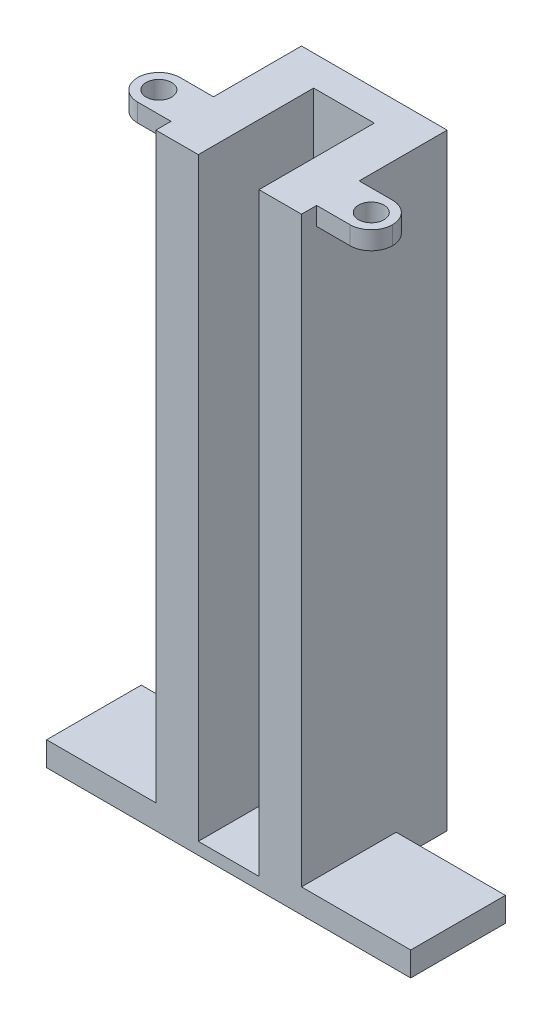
ISO-10303-21;
HEADER;
FILE_DESCRIPTION(('STEP AP214'),'2;1');
FILE_NAME('part.step','',(''),(''),'','','');
FILE_SCHEMA(('AUTOMOTIVE_DESIGN { 1 0 10303 214 1 1 1 1 }'));
ENDSEC;
DATA;
#1=APPLICATION_CONTEXT('core data for automotive mechanical design processes');
#2=APPLICATION_PROTOCOL_DEFINITION('international standard','automotive_design',2000,#1);
#3=PRODUCT_CONTEXT('',#1,'mechanical');
#4=PRODUCT('Part','Part','',(#3));
#5=PRODUCT_RELATED_PRODUCT_CATEGORY('part','',(#4));
#6=PRODUCT_DEFINITION_FORMATION('','',#4);
#7=PRODUCT_DEFINITION_CONTEXT('part definition',#1,'design');
#8=PRODUCT_DEFINITION('design','',#6,#7);
#9=PRODUCT_DEFINITION_SHAPE('','',#8);
#10=(LENGTH_UNIT() NAMED_UNIT(*) SI_UNIT(.MILLI.,.METRE.));
#11=(NAMED_UNIT(*) PLANE_ANGLE_UNIT() SI_UNIT($,.RADIAN.));
#12=(NAMED_UNIT(*) SI_UNIT($,.STERADIAN.) SOLID_ANGLE_UNIT());
#13=UNCERTAINTY_MEASURE_WITH_UNIT(LENGTH_MEASURE(1.E-05),#10,'distance_accuracy_value','');
#14=(GEOMETRIC_REPRESENTATION_CONTEXT(3) GLOBAL_UNCERTAINTY_ASSIGNED_CONTEXT((#13)) GLOBAL_UNIT_ASSIGNED_CONTEXT((#10,
#11,#12)) REPRESENTATION_CONTEXT('',''));
#15=CARTESIAN_POINT('',(0.,0.,0.));
#16=DIRECTION('',(0.,0.,1.));
#17=DIRECTION('',(1.,0.,0.));
#18=AXIS2_PLACEMENT_3D('',#15,#16,#17);
#19=CARTESIAN_POINT('',(12.,100.,-12.));
#20=DIRECTION('',(-1.,0.,0.));
#21=DIRECTION('',(0.,0.,1.));
#22=AXIS2_PLACEMENT_3D('',#19,#20,#21);
#23=PLANE('',#22);
#24=DIRECTION('',(0.,1.,0.));
#25=VECTOR('',#24,1.);
#26=CARTESIAN_POINT('',(12.,97.,2.50000000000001));
#27=LINE('',#26,#25);
#28=CARTESIAN_POINT('',(12.,97.,2.50000000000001));
#29=VERTEX_POINT('',#28);
#30=CARTESIAN_POINT('',(12.,100.,2.50000000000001));
#31=VERTEX_POINT('',#30);
#32=EDGE_CURVE('E197',#29,#31,#27,.T.);
#33=ORIENTED_EDGE('',*,*,#32,.F.);
#34=DIRECTION('',(0.,0.,-1.));
#35=VECTOR('',#34,1.);
#36=CARTESIAN_POINT('',(12.,97.,2.50000000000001));
#37=LINE('',#36,#35);
#38=CARTESIAN_POINT('',(12.,97.,9.50000000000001));
#39=VERTEX_POINT('',#38);
#40=EDGE_CURVE('E204',#39,#29,#37,.T.);
#41=ORIENTED_EDGE('',*,*,#40,.F.);
#42=DIRECTION('',(0.,1.,0.));
#43=VECTOR('',#42,1.);
#44=CARTESIAN_POINT('',(12.,97.,9.50000000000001));
#45=LINE('',#44,#43);
#46=CARTESIAN_POINT('',(12.,100.,9.50000000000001));
#47=VERTEX_POINT('',#46);
#48=EDGE_CURVE('E214',#39,#47,#45,.T.);
#49=ORIENTED_EDGE('',*,*,#48,.T.);
#50=DIRECTION('',(0.,0.,-1.));
#51=VECTOR('',#50,1.);
#52=CARTESIAN_POINT('',(12.,100.,-12.));
#53=LINE('',#52,#51);
#54=CARTESIAN_POINT('',(12.,100.,12.));
#55=VERTEX_POINT('',#54);
#56=EDGE_CURVE('E338',#55,#47,#53,.T.);
#57=ORIENTED_EDGE('',*,*,#56,.F.);
#58=DIRECTION('',(0.,-1.,0.));
#59=VECTOR('',#58,1.);
#60=CARTESIAN_POINT('',(12.,100.,12.));
#61=LINE('',#60,#59);
#62=CARTESIAN_POINT('',(12.,4.,12.));
#63=VERTEX_POINT('',#62);
#64=EDGE_CURVE('E354',#55,#63,#61,.T.);
#65=ORIENTED_EDGE('',*,*,#64,.T.);
#66=DIRECTION('',(0.,0.,-1.));
#67=VECTOR('',#66,1.);
#68=CARTESIAN_POINT('',(12.,4.,12.));
#69=LINE('',#68,#67);
#70=CARTESIAN_POINT('',(12.,4.,-3.59999999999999));
#71=VERTEX_POINT('',#70);
#72=EDGE_CURVE('E268',#63,#71,#69,.T.);
#73=ORIENTED_EDGE('',*,*,#72,.T.);
#74=DIRECTION('',(0.,1.,0.));
#75=VECTOR('',#74,1.);
#76=CARTESIAN_POINT('',(12.,-19.8635344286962,-3.6));
#77=LINE('',#76,#75);
#78=CARTESIAN_POINT('',(12.,0.,-3.59999999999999));
#79=VERTEX_POINT('',#78);
#80=EDGE_CURVE('E275',#79,#71,#77,.T.);
#81=ORIENTED_EDGE('',*,*,#80,.F.);
#82=DIRECTION('',(0.,0.,1.));
#83=VECTOR('',#82,1.);
#84=CARTESIAN_POINT('',(12.,0.,-12.));
#85=LINE('',#84,#83);
#86=CARTESIAN_POINT('',(12.,0.,-12.));
#87=VERTEX_POINT('',#86);
#88=EDGE_CURVE('E265',#87,#79,#85,.T.);
#89=ORIENTED_EDGE('',*,*,#88,.F.);
#90=DIRECTION('',(0.,-1.,0.));
#91=VECTOR('',#90,1.);
#92=CARTESIAN_POINT('',(12.,100.,-12.));
#93=LINE('',#92,#91);
#94=CARTESIAN_POINT('',(12.,100.,-12.));
#95=VERTEX_POINT('',#94);
#96=EDGE_CURVE('E366',#95,#87,#93,.T.);
#97=ORIENTED_EDGE('',*,*,#96,.F.);
#98=EDGE_CURVE('E207',#31,#95,#53,.T.);
#99=ORIENTED_EDGE('',*,*,#98,.F.);
#100=EDGE_LOOP('',(#33,#41,#49,#57,#65,#73,#81,#89,#97,#99));
#101=FACE_BOUND('',#100,.T.);
#102=ADVANCED_FACE('F41',(#101),#23,.F.);
#103=CARTESIAN_POINT('',(-12.,100.,-12.));
#104=DIRECTION('',(1.,0.,0.));
#105=DIRECTION('',(0.,0.,-1.));
#106=AXIS2_PLACEMENT_3D('',#103,#104,#105);
#107=PLANE('',#106);
#108=DIRECTION('',(0.,1.,0.));
#109=VECTOR('',#108,1.);
#110=CARTESIAN_POINT('',(-12.,97.,9.50000000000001));
#111=LINE('',#110,#109);
#112=CARTESIAN_POINT('',(-12.,97.,9.50000000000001));
#113=VERTEX_POINT('',#112);
#114=CARTESIAN_POINT('',(-12.,100.,9.50000000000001));
#115=VERTEX_POINT('',#114);
#116=EDGE_CURVE('E252',#113,#115,#111,.T.);
#117=ORIENTED_EDGE('',*,*,#116,.F.);
#118=DIRECTION('',(0.,0.,-1.));
#119=VECTOR('',#118,1.);
#120=CARTESIAN_POINT('',(-12.,97.,2.50000000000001));
#121=LINE('',#120,#119);
#122=CARTESIAN_POINT('',(-12.,97.,2.50000000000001));
#123=VERTEX_POINT('',#122);
#124=EDGE_CURVE('E238',#113,#123,#121,.T.);
#125=ORIENTED_EDGE('',*,*,#124,.T.);
#126=DIRECTION('',(0.,1.,0.));
#127=VECTOR('',#126,1.);
#128=CARTESIAN_POINT('',(-12.,97.,2.50000000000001));
#129=LINE('',#128,#127);
#130=CARTESIAN_POINT('',(-12.,100.,2.50000000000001));
#131=VERTEX_POINT('',#130);
#132=EDGE_CURVE('E246',#123,#131,#129,.T.);
#133=ORIENTED_EDGE('',*,*,#132,.T.);
#134=DIRECTION('',(0.,0.,1.));
#135=VECTOR('',#134,1.);
#136=CARTESIAN_POINT('',(-12.,100.,-12.));
#137=LINE('',#136,#135);
#138=CARTESIAN_POINT('',(-12.,100.,-12.));
#139=VERTEX_POINT('',#138);
#140=EDGE_CURVE('E346',#139,#131,#137,.T.);
#141=ORIENTED_EDGE('',*,*,#140,.F.);
#142=DIRECTION('',(0.,-1.,0.));
#143=VECTOR('',#142,1.);
#144=CARTESIAN_POINT('',(-12.,100.,-12.));
#145=LINE('',#144,#143);
#146=CARTESIAN_POINT('',(-12.,0.,-12.));
#147=VERTEX_POINT('',#146);
#148=EDGE_CURVE('E361',#139,#147,#145,.T.);
#149=ORIENTED_EDGE('',*,*,#148,.T.);
#150=DIRECTION('',(0.,0.,1.));
#151=VECTOR('',#150,1.);
#152=CARTESIAN_POINT('',(-12.,0.,-12.));
#153=LINE('',#152,#151);
#154=CARTESIAN_POINT('',(-12.,0.,-3.59999999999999));
#155=VERTEX_POINT('',#154);
#156=EDGE_CURVE('E288',#147,#155,#153,.T.);
#157=ORIENTED_EDGE('',*,*,#156,.T.);
#158=DIRECTION('',(0.,1.,0.));
#159=VECTOR('',#158,1.);
#160=CARTESIAN_POINT('',(-12.,-19.8635344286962,-3.6));
#161=LINE('',#160,#159);
#162=CARTESIAN_POINT('',(-12.,4.,-3.59999999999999));
#163=VERTEX_POINT('',#162);
#164=EDGE_CURVE('E292',#155,#163,#161,.T.);
#165=ORIENTED_EDGE('',*,*,#164,.T.);
#166=DIRECTION('',(0.,0.,-1.));
#167=VECTOR('',#166,1.);
#168=CARTESIAN_POINT('',(-12.,4.,12.));
#169=LINE('',#168,#167);
#170=CARTESIAN_POINT('',(-12.,4.,12.));
#171=VERTEX_POINT('',#170);
#172=EDGE_CURVE('E299',#171,#163,#169,.T.);
#173=ORIENTED_EDGE('',*,*,#172,.F.);
#174=DIRECTION('',(0.,-1.,0.));
#175=VECTOR('',#174,1.);
#176=CARTESIAN_POINT('',(-12.,100.,12.));
#177=LINE('',#176,#175);
#178=CARTESIAN_POINT('',(-12.,100.,12.));
#179=VERTEX_POINT('',#178);
#180=EDGE_CURVE('E359',#179,#171,#177,.T.);
#181=ORIENTED_EDGE('',*,*,#180,.F.);
#182=EDGE_CURVE('E342',#115,#179,#137,.T.);
#183=ORIENTED_EDGE('',*,*,#182,.F.);
#184=EDGE_LOOP('',(#117,#125,#133,#141,#149,#157,#165,#173,#181,#183));
#185=FACE_BOUND('',#184,.T.);
#186=ADVANCED_FACE('F417',(#185),#107,.F.);
#187=CARTESIAN_POINT('',(-12.,100.,-12.));
#188=DIRECTION('',(0.,0.,1.));
#189=DIRECTION('',(1.,0.,0.));
#190=AXIS2_PLACEMENT_3D('',#187,#188,#189);
#191=PLANE('',#190);
#192=ORIENTED_EDGE('',*,*,#96,.T.);
#193=DIRECTION('',(-1.,0.,0.));
#194=VECTOR('',#193,1.);
#195=CARTESIAN_POINT('',(-12.,0.,-12.));
#196=LINE('',#195,#194);
#197=EDGE_CURVE('E339',#87,#147,#196,.T.);
#198=ORIENTED_EDGE('',*,*,#197,.T.);
#199=ORIENTED_EDGE('',*,*,#148,.F.);
#200=DIRECTION('',(-1.,0.,0.));
#201=VECTOR('',#200,1.);
#202=CARTESIAN_POINT('',(-12.,100.,-12.));
#203=LINE('',#202,#201);
#204=EDGE_CURVE('E345',#95,#139,#203,.T.);
#205=ORIENTED_EDGE('',*,*,#204,.F.);
#206=EDGE_LOOP('',(#192,#198,#199,#205));
#207=FACE_BOUND('',#206,.T.);
#208=ADVANCED_FACE('F425',(#207),#191,.F.);
#209=CARTESIAN_POINT('',(30.,4.,12.));
#210=DIRECTION('',(0.,1.,0.));
#211=DIRECTION('',(0.,0.,1.));
#212=AXIS2_PLACEMENT_3D('',#209,#210,#211);
#213=PLANE('',#212);
#214=DIRECTION('',(0.,0.,-1.));
#215=VECTOR('',#214,1.);
#216=CARTESIAN_POINT('',(30.,4.,12.));
#217=LINE('',#216,#215);
#218=CARTESIAN_POINT('',(30.,4.,12.));
#219=VERTEX_POINT('',#218);
#220=CARTESIAN_POINT('',(30.,4.,-3.59999999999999));
#221=VERTEX_POINT('',#220);
#222=EDGE_CURVE('E281',#219,#221,#217,.T.);
#223=ORIENTED_EDGE('',*,*,#222,.T.);
#224=DIRECTION('',(-1.,0.,0.));
#225=VECTOR('',#224,1.);
#226=CARTESIAN_POINT('',(30.,4.,-3.59999999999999));
#227=LINE('',#226,#225);
#228=EDGE_CURVE('E258',#221,#71,#227,.T.);
#229=ORIENTED_EDGE('',*,*,#228,.T.);
#230=ORIENTED_EDGE('',*,*,#72,.F.);
#231=DIRECTION('',(-1.,0.,0.));
#232=VECTOR('',#231,1.);
#233=CARTESIAN_POINT('',(30.,4.,12.));
#234=LINE('',#233,#232);
#235=EDGE_CURVE('E282',#219,#63,#234,.T.);
#236=ORIENTED_EDGE('',*,*,#235,.F.);
#237=EDGE_LOOP('',(#223,#229,#230,#236));
#238=FACE_BOUND('',#237,.T.);
#239=ADVANCED_FACE('F513',(#238),#213,.T.);
#240=CARTESIAN_POINT('',(30.,0.,0.));
#241=DIRECTION('',(1.,0.,0.));
#242=DIRECTION('',(0.,0.,1.));
#243=AXIS2_PLACEMENT_3D('',#240,#241,#242);
#244=PLANE('',#243);
#245=DIRECTION('',(0.,0.,1.));
#246=VECTOR('',#245,1.);
#247=CARTESIAN_POINT('',(30.,0.,12.));
#248=LINE('',#247,#246);
#249=CARTESIAN_POINT('',(30.,0.,-3.59999999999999));
#250=VERTEX_POINT('',#249);
#251=CARTESIAN_POINT('',(30.,0.,12.));
#252=VERTEX_POINT('',#251);
#253=EDGE_CURVE('E278',#250,#252,#248,.T.);
#254=ORIENTED_EDGE('',*,*,#253,.F.);
#255=DIRECTION('',(0.,1.,0.));
#256=VECTOR('',#255,1.);
#257=CARTESIAN_POINT('',(30.,-19.8635344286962,-3.6));
#258=LINE('',#257,#256);
#259=EDGE_CURVE('E266',#250,#221,#258,.T.);
#260=ORIENTED_EDGE('',*,*,#259,.T.);
#261=ORIENTED_EDGE('',*,*,#222,.F.);
#262=DIRECTION('',(0.,1.,0.));
#263=VECTOR('',#262,1.);
#264=CARTESIAN_POINT('',(30.,0.,12.));
#265=LINE('',#264,#263);
#266=EDGE_CURVE('E279',#252,#219,#265,.T.);
#267=ORIENTED_EDGE('',*,*,#266,.F.);
#268=EDGE_LOOP('',(#254,#260,#261,#267));
#269=FACE_BOUND('',#268,.T.);
#270=ADVANCED_FACE('F515',(#269),#244,.T.);
#271=CARTESIAN_POINT('',(0.,0.,0.));
#272=DIRECTION('',(0.,1.,0.));
#273=DIRECTION('',(0.,0.,1.));
#274=AXIS2_PLACEMENT_3D('',#271,#272,#273);
#275=PLANE('',#274);
#276=ORIENTED_EDGE('',*,*,#88,.T.);
#277=DIRECTION('',(1.,0.,0.));
#278=VECTOR('',#277,1.);
#279=CARTESIAN_POINT('',(30.,0.,-3.59999999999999));
#280=LINE('',#279,#278);
#281=EDGE_CURVE('E264',#79,#250,#280,.T.);
#282=ORIENTED_EDGE('',*,*,#281,.T.);
#283=ORIENTED_EDGE('',*,*,#253,.T.);
#284=DIRECTION('',(1.,0.,0.));
#285=VECTOR('',#284,1.);
#286=CARTESIAN_POINT('',(-12.,0.,12.));
#287=LINE('',#286,#285);
#288=CARTESIAN_POINT('',(-30.,0.,12.));
#289=VERTEX_POINT('',#288);
#290=EDGE_CURVE('E355',#289,#252,#287,.T.);
#291=ORIENTED_EDGE('',*,*,#290,.F.);
#292=DIRECTION('',(0.,0.,1.));
#293=VECTOR('',#292,1.);
#294=CARTESIAN_POINT('',(-30.,0.,12.));
#295=LINE('',#294,#293);
#296=CARTESIAN_POINT('',(-30.,0.,-3.59999999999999));
#297=VERTEX_POINT('',#296);
#298=EDGE_CURVE('E306',#297,#289,#295,.T.);
#299=ORIENTED_EDGE('',*,*,#298,.F.);
#300=DIRECTION('',(-1.,0.,0.));
#301=VECTOR('',#300,1.);
#302=CARTESIAN_POINT('',(-30.,0.,-3.59999999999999));
#303=LINE('',#302,#301);
#304=EDGE_CURVE('E293',#155,#297,#303,.T.);
#305=ORIENTED_EDGE('',*,*,#304,.F.);
#306=ORIENTED_EDGE('',*,*,#156,.F.);
#307=ORIENTED_EDGE('',*,*,#197,.F.);
#308=EDGE_LOOP('',(#276,#282,#283,#291,#299,#305,#306,#307));
#309=FACE_BOUND('',#308,.T.);
#310=ADVANCED_FACE('F466',(#309),#275,.F.);
#311=CARTESIAN_POINT('',(-30.,4.,12.));
#312=DIRECTION('',(0.,-1.,0.));
#313=DIRECTION('',(0.,0.,-1.));
#314=AXIS2_PLACEMENT_3D('',#311,#312,#313);
#315=PLANE('',#314);
#316=DIRECTION('',(1.,0.,0.));
#317=VECTOR('',#316,1.);
#318=CARTESIAN_POINT('',(-30.,4.,-3.59999999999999));
#319=LINE('',#318,#317);
#320=CARTESIAN_POINT('',(-30.,4.,-3.59999999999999));
#321=VERTEX_POINT('',#320);
#322=EDGE_CURVE('E289',#321,#163,#319,.T.);
#323=ORIENTED_EDGE('',*,*,#322,.F.);
#324=DIRECTION('',(0.,0.,-1.));
#325=VECTOR('',#324,1.);
#326=CARTESIAN_POINT('',(-30.,4.,12.));
#327=LINE('',#326,#325);
#328=CARTESIAN_POINT('',(-30.,4.,12.));
#329=VERTEX_POINT('',#328);
#330=EDGE_CURVE('E303',#329,#321,#327,.T.);
#331=ORIENTED_EDGE('',*,*,#330,.F.);
#332=DIRECTION('',(1.,0.,0.));
#333=VECTOR('',#332,1.);
#334=CARTESIAN_POINT('',(-30.,4.,12.));
#335=LINE('',#334,#333);
#336=EDGE_CURVE('E308',#329,#171,#335,.T.);
#337=ORIENTED_EDGE('',*,*,#336,.T.);
#338=ORIENTED_EDGE('',*,*,#172,.T.);
#339=EDGE_LOOP('',(#323,#331,#337,#338));
#340=FACE_BOUND('',#339,.T.);
#341=ADVANCED_FACE('F479',(#340),#315,.F.);
#342=CARTESIAN_POINT('',(-12.,100.,12.));
#343=DIRECTION('',(0.,0.,-1.));
#344=DIRECTION('',(-1.,0.,0.));
#345=AXIS2_PLACEMENT_3D('',#342,#343,#344);
#346=PLANE('',#345);
#347=DIRECTION('',(0.,1.,0.));
#348=VECTOR('',#347,1.);
#349=CARTESIAN_POINT('',(5.,-21.4709105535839,12.));
#350=LINE('',#349,#348);
#351=CARTESIAN_POINT('',(5.,2.,12.));
#352=VERTEX_POINT('',#351);
#353=CARTESIAN_POINT('',(5.,100.,12.));
#354=VERTEX_POINT('',#353);
#355=EDGE_CURVE('E334',#352,#354,#350,.T.);
#356=ORIENTED_EDGE('',*,*,#355,.F.);
#357=DIRECTION('',(-1.,0.,0.));
#358=VECTOR('',#357,1.);
#359=CARTESIAN_POINT('',(-5.,2.,12.));
#360=LINE('',#359,#358);
#361=CARTESIAN_POINT('',(-5.,2.,12.));
#362=VERTEX_POINT('',#361);
#363=EDGE_CURVE('E324',#352,#362,#360,.T.);
#364=ORIENTED_EDGE('',*,*,#363,.T.);
#365=DIRECTION('',(0.,1.,0.));
#366=VECTOR('',#365,1.);
#367=CARTESIAN_POINT('',(-5.,-21.4709105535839,12.));
#368=LINE('',#367,#366);
#369=CARTESIAN_POINT('',(-5.,100.,12.));
#370=VERTEX_POINT('',#369);
#371=EDGE_CURVE('E328',#362,#370,#368,.T.);
#372=ORIENTED_EDGE('',*,*,#371,.T.);
#373=DIRECTION('',(1.,0.,0.));
#374=VECTOR('',#373,1.);
#375=CARTESIAN_POINT('',(-12.,100.,12.));
#376=LINE('',#375,#374);
#377=EDGE_CURVE('E349',#179,#370,#376,.T.);
#378=ORIENTED_EDGE('',*,*,#377,.F.);
#379=ORIENTED_EDGE('',*,*,#180,.T.);
#380=ORIENTED_EDGE('',*,*,#336,.F.);
#381=DIRECTION('',(0.,1.,0.));
#382=VECTOR('',#381,1.);
#383=CARTESIAN_POINT('',(-30.,0.,12.));
#384=LINE('',#383,#382);
#385=EDGE_CURVE('E297',#289,#329,#384,.T.);
#386=ORIENTED_EDGE('',*,*,#385,.F.);
#387=ORIENTED_EDGE('',*,*,#290,.T.);
#388=ORIENTED_EDGE('',*,*,#266,.T.);
#389=ORIENTED_EDGE('',*,*,#235,.T.);
#390=ORIENTED_EDGE('',*,*,#64,.F.);
#391=EDGE_CURVE('E347',#354,#55,#376,.T.);
#392=ORIENTED_EDGE('',*,*,#391,.F.);
#393=EDGE_LOOP('',(#356,#364,#372,#378,#379,#380,#386,#387,#388,#389,#390,#392));
#394=FACE_BOUND('',#393,.T.);
#395=ADVANCED_FACE('F488',(#394),#346,.F.);
#396=CARTESIAN_POINT('',(0.,100.,0.));
#397=DIRECTION('',(0.,1.,0.));
#398=DIRECTION('',(0.,0.,1.));
#399=AXIS2_PLACEMENT_3D('',#396,#397,#398);
#400=PLANE('',#399);
#401=CARTESIAN_POINT('',(17.5,100.,6.00000000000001));
#402=DIRECTION('',(0.,-1.,0.));
#403=DIRECTION('',(0.,0.,1.));
#404=AXIS2_PLACEMENT_3D('',#401,#402,#403);
#405=CIRCLE('',#404,2.1);
#406=CARTESIAN_POINT('',(17.5,100.,8.10000000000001));
#407=VERTEX_POINT('',#406);
#408=EDGE_CURVE('E400',#407,#407,#405,.T.);
#409=ORIENTED_EDGE('',*,*,#408,.T.);
#410=EDGE_LOOP('',(#409));
#411=FACE_BOUND('',#410,.T.);
#412=CARTESIAN_POINT('',(-17.5,100.,6.00000000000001));
#413=DIRECTION('',(0.,1.,0.));
#414=DIRECTION('',(0.,0.,1.));
#415=AXIS2_PLACEMENT_3D('',#412,#413,#414);
#416=CIRCLE('',#415,2.1);
#417=CARTESIAN_POINT('',(-17.5,100.,8.10000000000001));
#418=VERTEX_POINT('',#417);
#419=EDGE_CURVE('E208',#418,#418,#416,.T.);
#420=ORIENTED_EDGE('',*,*,#419,.F.);
#421=EDGE_LOOP('',(#420));
#422=FACE_BOUND('',#421,.T.);
#423=CARTESIAN_POINT('',(17.5,100.,6.00000000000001));
#424=DIRECTION('',(0.,1.,0.));
#425=DIRECTION('',(0.,0.,1.));
#426=AXIS2_PLACEMENT_3D('',#423,#424,#425);
#427=CIRCLE('',#426,3.5);
#428=CARTESIAN_POINT('',(17.5,100.,9.50000000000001));
#429=VERTEX_POINT('',#428);
#430=CARTESIAN_POINT('',(21.,100.,6.00000000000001));
#431=VERTEX_POINT('',#430);
#432=EDGE_CURVE('E382',#429,#431,#427,.T.);
#433=ORIENTED_EDGE('',*,*,#432,.T.);
#434=CARTESIAN_POINT('',(17.5,100.,6.00000000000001));
#435=DIRECTION('',(0.,1.,0.));
#436=DIRECTION('',(0.,0.,1.));
#437=AXIS2_PLACEMENT_3D('',#434,#435,#436);
#438=CIRCLE('',#437,3.5);
#439=CARTESIAN_POINT('',(17.5,100.,2.50000000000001));
#440=VERTEX_POINT('',#439);
#441=EDGE_CURVE('E383',#431,#440,#438,.T.);
#442=ORIENTED_EDGE('',*,*,#441,.T.);
#443=DIRECTION('',(1.,0.,0.));
#444=VECTOR('',#443,1.);
#445=CARTESIAN_POINT('',(21.,100.,2.50000000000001));
#446=LINE('',#445,#444);
#447=EDGE_CURVE('E221',#31,#440,#446,.T.);
#448=ORIENTED_EDGE('',*,*,#447,.F.);
#449=ORIENTED_EDGE('',*,*,#98,.T.);
#450=ORIENTED_EDGE('',*,*,#204,.T.);
#451=ORIENTED_EDGE('',*,*,#140,.T.);
#452=DIRECTION('',(-1.,0.,0.));
#453=VECTOR('',#452,1.);
#454=CARTESIAN_POINT('',(-21.,100.,2.50000000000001));
#455=LINE('',#454,#453);
#456=CARTESIAN_POINT('',(-17.5,100.,2.50000000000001));
#457=VERTEX_POINT('',#456);
#458=EDGE_CURVE('E250',#131,#457,#455,.T.);
#459=ORIENTED_EDGE('',*,*,#458,.T.);
#460=CARTESIAN_POINT('',(-17.5,100.,6.00000000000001));
#461=DIRECTION('',(0.,1.,0.));
#462=DIRECTION('',(0.,0.,1.));
#463=AXIS2_PLACEMENT_3D('',#460,#461,#462);
#464=CIRCLE('',#463,3.5);
#465=CARTESIAN_POINT('',(-21.,100.,6.00000000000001));
#466=VERTEX_POINT('',#465);
#467=EDGE_CURVE('E373',#457,#466,#464,.T.);
#468=ORIENTED_EDGE('',*,*,#467,.T.);
#469=CARTESIAN_POINT('',(-17.5,100.,6.00000000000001));
#470=DIRECTION('',(0.,1.,0.));
#471=DIRECTION('',(0.,0.,1.));
#472=AXIS2_PLACEMENT_3D('',#469,#470,#471);
#473=CIRCLE('',#472,3.5);
#474=CARTESIAN_POINT('',(-17.5,100.,9.50000000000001));
#475=VERTEX_POINT('',#474);
#476=EDGE_CURVE('E371',#466,#475,#473,.T.);
#477=ORIENTED_EDGE('',*,*,#476,.T.);
#478=DIRECTION('',(1.,0.,0.));
#479=VECTOR('',#478,1.);
#480=CARTESIAN_POINT('',(-21.,100.,9.50000000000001));
#481=LINE('',#480,#479);
#482=EDGE_CURVE('E241',#475,#115,#481,.T.);
#483=ORIENTED_EDGE('',*,*,#482,.T.);
#484=ORIENTED_EDGE('',*,*,#182,.T.);
#485=ORIENTED_EDGE('',*,*,#377,.T.);
#486=DIRECTION('',(0.,0.,1.));
#487=VECTOR('',#486,1.);
#488=CARTESIAN_POINT('',(-5.,100.,12.));
#489=LINE('',#488,#487);
#490=CARTESIAN_POINT('',(-5.,100.,-7.));
#491=VERTEX_POINT('',#490);
#492=EDGE_CURVE('E312',#491,#370,#489,.T.);
#493=ORIENTED_EDGE('',*,*,#492,.F.);
#494=DIRECTION('',(-1.,0.,0.));
#495=VECTOR('',#494,1.);
#496=CARTESIAN_POINT('',(-5.,100.,-7.));
#497=LINE('',#496,#495);
#498=CARTESIAN_POINT('',(5.,100.,-7.));
#499=VERTEX_POINT('',#498);
#500=EDGE_CURVE('E322',#499,#491,#497,.T.);
#501=ORIENTED_EDGE('',*,*,#500,.F.);
#502=DIRECTION('',(0.,0.,-1.));
#503=VECTOR('',#502,1.);
#504=CARTESIAN_POINT('',(5.,100.,12.));
#505=LINE('',#504,#503);
#506=EDGE_CURVE('E325',#354,#499,#505,.T.);
#507=ORIENTED_EDGE('',*,*,#506,.F.);
#508=ORIENTED_EDGE('',*,*,#391,.T.);
#509=ORIENTED_EDGE('',*,*,#56,.T.);
#510=DIRECTION('',(-1.,0.,0.));
#511=VECTOR('',#510,1.);
#512=CARTESIAN_POINT('',(21.,100.,9.50000000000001));
#513=LINE('',#512,#511);
#514=EDGE_CURVE('E223',#429,#47,#513,.T.);
#515=ORIENTED_EDGE('',*,*,#514,.F.);
#516=EDGE_LOOP('',(#433,#442,#448,#449,#450,#451,#459,#468,#477,#483,#484,#485,#493,#501,#507,
#508,#509,#515));
#517=FACE_BOUND('',#516,.T.);
#518=ADVANCED_FACE('F391',(#411,#422,#517),#400,.T.);
#519=CARTESIAN_POINT('',(-5.,-21.4709105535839,12.));
#520=DIRECTION('',(-1.,0.,0.));
#521=DIRECTION('',(0.,0.,1.));
#522=AXIS2_PLACEMENT_3D('',#519,#520,#521);
#523=PLANE('',#522);
#524=DIRECTION('',(0.,0.,-1.));
#525=VECTOR('',#524,1.);
#526=CARTESIAN_POINT('',(-5.,2.,12.));
#527=LINE('',#526,#525);
#528=CARTESIAN_POINT('',(-5.,2.,-7.));
#529=VERTEX_POINT('',#528);
#530=EDGE_CURVE('E316',#362,#529,#527,.T.);
#531=ORIENTED_EDGE('',*,*,#530,.T.);
#532=DIRECTION('',(0.,1.,0.));
#533=VECTOR('',#532,1.);
#534=CARTESIAN_POINT('',(-5.,-21.4709105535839,-7.));
#535=LINE('',#534,#533);
#536=EDGE_CURVE('E320',#529,#491,#535,.T.);
#537=ORIENTED_EDGE('',*,*,#536,.T.);
#538=ORIENTED_EDGE('',*,*,#492,.T.);
#539=ORIENTED_EDGE('',*,*,#371,.F.);
#540=EDGE_LOOP('',(#531,#537,#538,#539));
#541=FACE_BOUND('',#540,.T.);
#542=ADVANCED_FACE('F534',(#541),#523,.F.);
#543=CARTESIAN_POINT('',(-5.,-21.4709105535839,-7.));
#544=DIRECTION('',(0.,0.,-1.));
#545=DIRECTION('',(-1.,0.,0.));
#546=AXIS2_PLACEMENT_3D('',#543,#544,#545);
#547=PLANE('',#546);
#548=DIRECTION('',(1.,0.,0.));
#549=VECTOR('',#548,1.);
#550=CARTESIAN_POINT('',(-5.,2.,-7.));
#551=LINE('',#550,#549);
#552=CARTESIAN_POINT('',(5.,2.,-6.99999999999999));
#553=VERTEX_POINT('',#552);
#554=EDGE_CURVE('E317',#529,#553,#551,.T.);
#555=ORIENTED_EDGE('',*,*,#554,.T.);
#556=DIRECTION('',(0.,1.,0.));
#557=VECTOR('',#556,1.);
#558=CARTESIAN_POINT('',(5.,-21.4709105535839,-7.));
#559=LINE('',#558,#557);
#560=EDGE_CURVE('E329',#553,#499,#559,.T.);
#561=ORIENTED_EDGE('',*,*,#560,.T.);
#562=ORIENTED_EDGE('',*,*,#500,.T.);
#563=ORIENTED_EDGE('',*,*,#536,.F.);
#564=EDGE_LOOP('',(#555,#561,#562,#563));
#565=FACE_BOUND('',#564,.T.);
#566=ADVANCED_FACE('F532',(#565),#547,.F.);
#567=CARTESIAN_POINT('',(5.,-21.4709105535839,12.));
#568=DIRECTION('',(1.,0.,0.));
#569=DIRECTION('',(0.,0.,-1.));
#570=AXIS2_PLACEMENT_3D('',#567,#568,#569);
#571=PLANE('',#570);
#572=DIRECTION('',(0.,0.,1.));
#573=VECTOR('',#572,1.);
#574=CARTESIAN_POINT('',(5.,2.,12.));
#575=LINE('',#574,#573);
#576=EDGE_CURVE('E313',#553,#352,#575,.T.);
#577=ORIENTED_EDGE('',*,*,#576,.T.);
#578=ORIENTED_EDGE('',*,*,#355,.T.);
#579=ORIENTED_EDGE('',*,*,#506,.T.);
#580=ORIENTED_EDGE('',*,*,#560,.F.);
#581=EDGE_LOOP('',(#577,#578,#579,#580));
#582=FACE_BOUND('',#581,.T.);
#583=ADVANCED_FACE('F528',(#582),#571,.F.);
#584=CARTESIAN_POINT('',(0.,2.,0.));
#585=DIRECTION('',(0.,1.,0.));
#586=DIRECTION('',(0.,0.,1.));
#587=AXIS2_PLACEMENT_3D('',#584,#585,#586);
#588=PLANE('',#587);
#589=CARTESIAN_POINT('',(0.,2.,-2.));
#590=DIRECTION('',(0.,1.,0.));
#591=DIRECTION('',(0.,0.,1.));
#592=AXIS2_PLACEMENT_3D('',#589,#590,#591);
#593=CIRCLE('',#592,4.);
#594=CARTESIAN_POINT('',(0.,2.,2.));
#595=VERTEX_POINT('',#594);
#596=EDGE_CURVE('E251',#595,#595,#593,.T.);
#597=ORIENTED_EDGE('',*,*,#596,.F.);
#598=EDGE_LOOP('',(#597));
#599=FACE_BOUND('',#598,.T.);
#600=ORIENTED_EDGE('',*,*,#530,.F.);
#601=ORIENTED_EDGE('',*,*,#363,.F.);
#602=ORIENTED_EDGE('',*,*,#576,.F.);
#603=ORIENTED_EDGE('',*,*,#554,.F.);
#604=EDGE_LOOP('',(#600,#601,#602,#603));
#605=FACE_BOUND('',#604,.T.);
#606=ADVANCED_FACE('F522',(#599,#605),#588,.T.);
#607=CARTESIAN_POINT('',(-30.,0.,0.));
#608=DIRECTION('',(-1.,0.,0.));
#609=DIRECTION('',(0.,0.,1.));
#610=AXIS2_PLACEMENT_3D('',#607,#608,#609);
#611=PLANE('',#610);
#612=DIRECTION('',(0.,1.,0.));
#613=VECTOR('',#612,1.);
#614=CARTESIAN_POINT('',(-30.,-19.8635344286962,-3.6));
#615=LINE('',#614,#613);
#616=EDGE_CURVE('E294',#297,#321,#615,.T.);
#617=ORIENTED_EDGE('',*,*,#616,.F.);
#618=ORIENTED_EDGE('',*,*,#298,.T.);
#619=ORIENTED_EDGE('',*,*,#385,.T.);
#620=ORIENTED_EDGE('',*,*,#330,.T.);
#621=EDGE_LOOP('',(#617,#618,#619,#620));
#622=FACE_BOUND('',#621,.T.);
#623=ADVANCED_FACE('F476',(#622),#611,.T.);
#624=CARTESIAN_POINT('',(-30.,-19.8635344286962,-3.6));
#625=DIRECTION('',(0.,0.,1.));
#626=DIRECTION('',(0.,-1.,0.));
#627=AXIS2_PLACEMENT_3D('',#624,#625,#626);
#628=PLANE('',#627);
#629=ORIENTED_EDGE('',*,*,#304,.T.);
#630=ORIENTED_EDGE('',*,*,#616,.T.);
#631=ORIENTED_EDGE('',*,*,#322,.T.);
#632=ORIENTED_EDGE('',*,*,#164,.F.);
#633=EDGE_LOOP('',(#629,#630,#631,#632));
#634=FACE_BOUND('',#633,.T.);
#635=ADVANCED_FACE('F475',(#634),#628,.F.);
#636=CARTESIAN_POINT('',(30.,-19.8635344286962,-3.6));
#637=DIRECTION('',(0.,0.,-1.));
#638=DIRECTION('',(0.,1.,0.));
#639=AXIS2_PLACEMENT_3D('',#636,#637,#638);
#640=PLANE('',#639);
#641=ORIENTED_EDGE('',*,*,#80,.T.);
#642=ORIENTED_EDGE('',*,*,#228,.F.);
#643=ORIENTED_EDGE('',*,*,#259,.F.);
#644=ORIENTED_EDGE('',*,*,#281,.F.);
#645=EDGE_LOOP('',(#641,#642,#643,#644));
#646=FACE_BOUND('',#645,.T.);
#647=ADVANCED_FACE('F510',(#646),#640,.T.);
#648=CARTESIAN_POINT('',(0.,1.,-2.));
#649=DIRECTION('',(0.,1.,0.));
#650=DIRECTION('',(0.,0.,1.));
#651=AXIS2_PLACEMENT_3D('',#648,#649,#650);
#652=CYLINDRICAL_SURFACE('',#651,4.);
#653=CARTESIAN_POINT('',(0.,1.,-2.));
#654=DIRECTION('',(0.,1.,0.));
#655=DIRECTION('',(0.,0.,1.));
#656=AXIS2_PLACEMENT_3D('',#653,#654,#655);
#657=CIRCLE('',#656,4.);
#658=CARTESIAN_POINT('',(0.,1.,2.));
#659=VERTEX_POINT('',#658);
#660=EDGE_CURVE('E259',#659,#659,#657,.T.);
#661=ORIENTED_EDGE('',*,*,#660,.F.);
#662=EDGE_LOOP('',(#661));
#663=FACE_BOUND('',#662,.T.);
#664=ORIENTED_EDGE('',*,*,#596,.T.);
#665=EDGE_LOOP('',(#664));
#666=FACE_BOUND('',#665,.T.);
#667=ADVANCED_FACE('F499',(#663,#666),#652,.F.);
#668=CARTESIAN_POINT('',(0.,1.,-2.));
#669=DIRECTION('',(0.,1.,0.));
#670=DIRECTION('',(0.,0.,1.));
#671=AXIS2_PLACEMENT_3D('',#668,#669,#670);
#672=PLANE('',#671);
#673=ORIENTED_EDGE('',*,*,#660,.T.);
#674=EDGE_LOOP('',(#673));
#675=FACE_BOUND('',#674,.T.);
#676=ADVANCED_FACE('F494',(#675),#672,.T.);
#677=CARTESIAN_POINT('',(-21.,97.,9.50000000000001));
#678=DIRECTION('',(0.,0.,1.));
#679=DIRECTION('',(1.,0.,0.));
#680=AXIS2_PLACEMENT_3D('',#677,#678,#679);
#681=PLANE('',#680);
#682=ORIENTED_EDGE('',*,*,#482,.F.);
#683=DIRECTION('',(0.,1.,0.));
#684=VECTOR('',#683,1.);
#685=CARTESIAN_POINT('',(-17.5,97.,9.50000000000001));
#686=LINE('',#685,#684);
#687=CARTESIAN_POINT('',(-17.5,97.,9.50000000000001));
#688=VERTEX_POINT('',#687);
#689=EDGE_CURVE('E378',#475,#688,#686,.F.);
#690=ORIENTED_EDGE('',*,*,#689,.T.);
#691=DIRECTION('',(1.,0.,0.));
#692=VECTOR('',#691,1.);
#693=CARTESIAN_POINT('',(-21.,97.,9.50000000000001));
#694=LINE('',#693,#692);
#695=EDGE_CURVE('E242',#688,#113,#694,.T.);
#696=ORIENTED_EDGE('',*,*,#695,.T.);
#697=ORIENTED_EDGE('',*,*,#116,.T.);
#698=EDGE_LOOP('',(#682,#690,#696,#697));
#699=FACE_BOUND('',#698,.T.);
#700=ADVANCED_FACE('F495',(#699),#681,.T.);
#701=CARTESIAN_POINT('',(-21.,97.,2.50000000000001));
#702=DIRECTION('',(0.,0.,-1.));
#703=DIRECTION('',(-1.,0.,0.));
#704=AXIS2_PLACEMENT_3D('',#701,#702,#703);
#705=PLANE('',#704);
#706=DIRECTION('',(-1.,0.,0.));
#707=VECTOR('',#706,1.);
#708=CARTESIAN_POINT('',(-21.,97.,2.50000000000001));
#709=LINE('',#708,#707);
#710=CARTESIAN_POINT('',(-17.5,97.,2.50000000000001));
#711=VERTEX_POINT('',#710);
#712=EDGE_CURVE('E239',#123,#711,#709,.T.);
#713=ORIENTED_EDGE('',*,*,#712,.T.);
#714=DIRECTION('',(0.,1.,0.));
#715=VECTOR('',#714,1.);
#716=CARTESIAN_POINT('',(-17.5,97.,2.50000000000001));
#717=LINE('',#716,#715);
#718=EDGE_CURVE('E368',#711,#457,#717,.T.);
#719=ORIENTED_EDGE('',*,*,#718,.T.);
#720=ORIENTED_EDGE('',*,*,#458,.F.);
#721=ORIENTED_EDGE('',*,*,#132,.F.);
#722=EDGE_LOOP('',(#713,#719,#720,#721));
#723=FACE_BOUND('',#722,.T.);
#724=ADVANCED_FACE('F445',(#723),#705,.T.);
#725=CARTESIAN_POINT('',(0.,97.,0.));
#726=DIRECTION('',(0.,1.,0.));
#727=DIRECTION('',(0.,0.,1.));
#728=AXIS2_PLACEMENT_3D('',#725,#726,#727);
#729=PLANE('',#728);
#730=CARTESIAN_POINT('',(-17.5,97.,6.00000000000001));
#731=DIRECTION('',(0.,1.,0.));
#732=DIRECTION('',(0.,0.,1.));
#733=AXIS2_PLACEMENT_3D('',#730,#731,#732);
#734=CIRCLE('',#733,2.1);
#735=CARTESIAN_POINT('',(-17.5,97.,8.10000000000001));
#736=VERTEX_POINT('',#735);
#737=EDGE_CURVE('E234',#736,#736,#734,.F.);
#738=ORIENTED_EDGE('',*,*,#737,.F.);
#739=EDGE_LOOP('',(#738));
#740=FACE_BOUND('',#739,.T.);
#741=CARTESIAN_POINT('',(-17.5,97.,6.00000000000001));
#742=DIRECTION('',(0.,1.,0.));
#743=DIRECTION('',(0.,0.,1.));
#744=AXIS2_PLACEMENT_3D('',#741,#742,#743);
#745=CIRCLE('',#744,3.5);
#746=CARTESIAN_POINT('',(-21.,97.,6.00000000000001));
#747=VERTEX_POINT('',#746);
#748=EDGE_CURVE('E374',#688,#747,#745,.F.);
#749=ORIENTED_EDGE('',*,*,#748,.T.);
#750=CARTESIAN_POINT('',(-17.5,97.,6.00000000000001));
#751=DIRECTION('',(0.,1.,0.));
#752=DIRECTION('',(0.,0.,1.));
#753=AXIS2_PLACEMENT_3D('',#750,#751,#752);
#754=CIRCLE('',#753,3.5);
#755=EDGE_CURVE('E380',#747,#711,#754,.F.);
#756=ORIENTED_EDGE('',*,*,#755,.T.);
#757=ORIENTED_EDGE('',*,*,#712,.F.);
#758=ORIENTED_EDGE('',*,*,#124,.F.);
#759=ORIENTED_EDGE('',*,*,#695,.F.);
#760=EDGE_LOOP('',(#749,#756,#757,#758,#759));
#761=FACE_BOUND('',#760,.T.);
#762=ADVANCED_FACE('F436',(#740,#761),#729,.F.);
#763=CARTESIAN_POINT('',(-17.5,97.,6.00000000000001));
#764=DIRECTION('',(0.,1.,0.));
#765=DIRECTION('',(0.,0.,1.));
#766=AXIS2_PLACEMENT_3D('',#763,#764,#765);
#767=CYLINDRICAL_SURFACE('',#766,3.5);
#768=DIRECTION('',(0.,1.,0.));
#769=VECTOR('',#768,1.);
#770=CARTESIAN_POINT('',(-21.,97.,6.00000000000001));
#771=LINE('',#770,#769);
#772=EDGE_CURVE('E240',#747,#466,#771,.T.);
#773=ORIENTED_EDGE('',*,*,#772,.F.);
#774=ORIENTED_EDGE('',*,*,#748,.F.);
#775=ORIENTED_EDGE('',*,*,#689,.F.);
#776=ORIENTED_EDGE('',*,*,#476,.F.);
#777=EDGE_LOOP('',(#773,#774,#775,#776));
#778=FACE_BOUND('',#777,.T.);
#779=ADVANCED_FACE('F433',(#778),#767,.T.);
#780=CARTESIAN_POINT('',(-17.5,97.,6.00000000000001));
#781=DIRECTION('',(0.,1.,0.));
#782=DIRECTION('',(0.,0.,1.));
#783=AXIS2_PLACEMENT_3D('',#780,#781,#782);
#784=CYLINDRICAL_SURFACE('',#783,3.5);
#785=ORIENTED_EDGE('',*,*,#755,.F.);
#786=ORIENTED_EDGE('',*,*,#772,.T.);
#787=ORIENTED_EDGE('',*,*,#467,.F.);
#788=ORIENTED_EDGE('',*,*,#718,.F.);
#789=EDGE_LOOP('',(#785,#786,#787,#788));
#790=FACE_BOUND('',#789,.T.);
#791=ADVANCED_FACE('F429',(#790),#784,.T.);
#792=CARTESIAN_POINT('',(-17.5,91.060303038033,6.00000000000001));
#793=DIRECTION('',(0.,1.,0.));
#794=DIRECTION('',(0.,0.,1.));
#795=AXIS2_PLACEMENT_3D('',#792,#793,#794);
#796=CYLINDRICAL_SURFACE('',#795,2.1);
#797=CARTESIAN_POINT('',(-17.5,97.,8.10000000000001));
#798=CARTESIAN_POINT('',(-17.5,97.03125,8.10000000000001));
#799=CARTESIAN_POINT('',(-17.5,97.0625,8.10000000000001));
#800=CARTESIAN_POINT('',(-17.5,97.125,8.10000000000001));
#801=CARTESIAN_POINT('',(-17.5,97.15625,8.10000000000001));
#802=CARTESIAN_POINT('',(-17.5,97.21875,8.10000000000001));
#803=CARTESIAN_POINT('',(-17.5,97.25,8.10000000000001));
#804=CARTESIAN_POINT('',(-17.5,97.3125,8.10000000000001));
#805=CARTESIAN_POINT('',(-17.5,97.34375,8.10000000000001));
#806=CARTESIAN_POINT('',(-17.5,97.40625,8.10000000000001));
#807=CARTESIAN_POINT('',(-17.5,97.4375,8.10000000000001));
#808=CARTESIAN_POINT('',(-17.5,97.5,8.10000000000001));
#809=CARTESIAN_POINT('',(-17.5,97.53125,8.10000000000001));
#810=CARTESIAN_POINT('',(-17.5,97.59375,8.10000000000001));
#811=CARTESIAN_POINT('',(-17.5,97.625,8.10000000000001));
#812=CARTESIAN_POINT('',(-17.5,97.6875,8.10000000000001));
#813=CARTESIAN_POINT('',(-17.5,97.71875,8.10000000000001));
#814=CARTESIAN_POINT('',(-17.5,97.78125,8.10000000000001));
#815=CARTESIAN_POINT('',(-17.5,97.8125,8.10000000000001));
#816=CARTESIAN_POINT('',(-17.5,97.875,8.10000000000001));
#817=CARTESIAN_POINT('',(-17.5,97.90625,8.10000000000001));
#818=CARTESIAN_POINT('',(-17.5,97.96875,8.10000000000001));
#819=CARTESIAN_POINT('',(-17.5,98.,8.10000000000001));
#820=CARTESIAN_POINT('',(-17.5,98.0625,8.10000000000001));
#821=CARTESIAN_POINT('',(-17.5,98.09375,8.10000000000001));
#822=CARTESIAN_POINT('',(-17.5,98.15625,8.10000000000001));
#823=CARTESIAN_POINT('',(-17.5,98.1875,8.10000000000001));
#824=CARTESIAN_POINT('',(-17.5,98.25,8.10000000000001));
#825=CARTESIAN_POINT('',(-17.5,98.28125,8.10000000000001));
#826=CARTESIAN_POINT('',(-17.5,98.34375,8.10000000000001));
#827=CARTESIAN_POINT('',(-17.5,98.375,8.10000000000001));
#828=CARTESIAN_POINT('',(-17.5,98.4375,8.10000000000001));
#829=CARTESIAN_POINT('',(-17.5,98.46875,8.10000000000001));
#830=CARTESIAN_POINT('',(-17.5,98.53125,8.10000000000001));
#831=CARTESIAN_POINT('',(-17.5,98.5625,8.10000000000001));
#832=CARTESIAN_POINT('',(-17.5,98.625,8.10000000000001));
#833=CARTESIAN_POINT('',(-17.5,98.65625,8.10000000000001));
#834=CARTESIAN_POINT('',(-17.5,98.71875,8.10000000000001));
#835=CARTESIAN_POINT('',(-17.5,98.75,8.10000000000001));
#836=CARTESIAN_POINT('',(-17.5,98.8125,8.10000000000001));
#837=CARTESIAN_POINT('',(-17.5,98.84375,8.10000000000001));
#838=CARTESIAN_POINT('',(-17.5,98.90625,8.10000000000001));
#839=CARTESIAN_POINT('',(-17.5,98.9375,8.10000000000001));
#840=CARTESIAN_POINT('',(-17.5,99.,8.10000000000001));
#841=CARTESIAN_POINT('',(-17.5,99.03125,8.10000000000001));
#842=CARTESIAN_POINT('',(-17.5,99.09375,8.10000000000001));
#843=CARTESIAN_POINT('',(-17.5,99.125,8.10000000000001));
#844=CARTESIAN_POINT('',(-17.5,99.1875,8.10000000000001));
#845=CARTESIAN_POINT('',(-17.5,99.21875,8.10000000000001));
#846=CARTESIAN_POINT('',(-17.5,99.28125,8.10000000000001));
#847=CARTESIAN_POINT('',(-17.5,99.3125,8.10000000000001));
#848=CARTESIAN_POINT('',(-17.5,99.375,8.10000000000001));
#849=CARTESIAN_POINT('',(-17.5,99.40625,8.10000000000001));
#850=CARTESIAN_POINT('',(-17.5,99.46875,8.10000000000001));
#851=CARTESIAN_POINT('',(-17.5,99.5,8.10000000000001));
#852=CARTESIAN_POINT('',(-17.5,99.5625,8.10000000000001));
#853=CARTESIAN_POINT('',(-17.5,99.59375,8.10000000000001));
#854=CARTESIAN_POINT('',(-17.5,99.65625,8.10000000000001));
#855=CARTESIAN_POINT('',(-17.5,99.6875,8.10000000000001));
#856=CARTESIAN_POINT('',(-17.5,99.75,8.10000000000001));
#857=CARTESIAN_POINT('',(-17.5,99.78125,8.10000000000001));
#858=CARTESIAN_POINT('',(-17.5,99.84375,8.10000000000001));
#859=CARTESIAN_POINT('',(-17.5,99.875,8.10000000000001));
#860=CARTESIAN_POINT('',(-17.5,99.9375,8.10000000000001));
#861=CARTESIAN_POINT('',(-17.5,99.96875,8.10000000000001));
#862=CARTESIAN_POINT('',(-17.5,100.,8.10000000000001));
#863=B_SPLINE_CURVE_WITH_KNOTS('',3,(#797,#798,#799,#800,#801,#802,#803,#804,#805,#806,#807,
#808,#809,#810,#811,#812,#813,#814,#815,#816,#817,#818,#819,#820,#821,#822,#823,#824,#825,#826,
#827,#828,#829,#830,#831,#832,#833,#834,#835,#836,#837,#838,#839,#840,#841,#842,#843,#844,#845,
#846,#847,#848,#849,#850,#851,#852,#853,#854,#855,#856,#857,#858,#859,#860,#861,#862),
.UNSPECIFIED.,.F.,.F.,(4,2,2,2,2,2,2,2,2,2,2,2,2,2,2,2,2,2,2,2,2,2,2,2,2,2,2,2,2,2,2,2,4),(0.,
0.0937500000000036,0.187500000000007,0.281250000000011,0.375,0.468750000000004,
0.562500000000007,0.656250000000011,0.750000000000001,0.843750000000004,0.937500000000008,
1.03125000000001,1.125,1.21875,1.31250000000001,1.40625000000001,1.5,1.59375,1.68750000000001,
1.78125000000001,1.875,1.96875000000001,2.06250000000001,2.15625000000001,2.25,2.34375000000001,
2.43750000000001,2.53125000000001,2.625,2.71875000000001,2.81250000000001,2.90625000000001,3.),.UNSPECIFIED.);
#864=EDGE_CURVE('BSEAM435',#736,#418,#863,.T.);
#865=ORIENTED_EDGE('',*,*,#737,.T.);
#866=ORIENTED_EDGE('',*,*,#419,.T.);
#867=ORIENTED_EDGE('',*,*,#864,.T.);
#868=ORIENTED_EDGE('',*,*,#864,.F.);
#869=EDGE_LOOP('',(#865,#867,#866,#868));
#870=FACE_BOUND('',#869,.T.);
#871=ADVANCED_FACE('F435',(#870),#796,.F.);
#872=CARTESIAN_POINT('',(21.,97.,2.50000000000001));
#873=DIRECTION('',(0.,0.,1.));
#874=DIRECTION('',(1.,0.,0.));
#875=AXIS2_PLACEMENT_3D('',#872,#873,#874);
#876=PLANE('',#875);
#877=ORIENTED_EDGE('',*,*,#447,.T.);
#878=DIRECTION('',(0.,1.,0.));
#879=VECTOR('',#878,1.);
#880=CARTESIAN_POINT('',(17.5,97.,2.50000000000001));
#881=LINE('',#880,#879);
#882=CARTESIAN_POINT('',(17.5,97.,2.50000000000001));
#883=VERTEX_POINT('',#882);
#884=EDGE_CURVE('E220',#440,#883,#881,.F.);
#885=ORIENTED_EDGE('',*,*,#884,.T.);
#886=DIRECTION('',(1.,0.,0.));
#887=VECTOR('',#886,1.);
#888=CARTESIAN_POINT('',(21.,97.,2.50000000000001));
#889=LINE('',#888,#887);
#890=EDGE_CURVE('E213',#29,#883,#889,.T.);
#891=ORIENTED_EDGE('',*,*,#890,.F.);
#892=ORIENTED_EDGE('',*,*,#32,.T.);
#893=EDGE_LOOP('',(#877,#885,#891,#892));
#894=FACE_BOUND('',#893,.T.);
#895=ADVANCED_FACE('F212',(#894),#876,.F.);
#896=CARTESIAN_POINT('',(21.,97.,9.50000000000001));
#897=DIRECTION('',(0.,0.,-1.));
#898=DIRECTION('',(-1.,0.,0.));
#899=AXIS2_PLACEMENT_3D('',#896,#897,#898);
#900=PLANE('',#899);
#901=DIRECTION('',(-1.,0.,0.));
#902=VECTOR('',#901,1.);
#903=CARTESIAN_POINT('',(21.,97.,9.50000000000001));
#904=LINE('',#903,#902);
#905=CARTESIAN_POINT('',(17.5,97.,9.50000000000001));
#906=VERTEX_POINT('',#905);
#907=EDGE_CURVE('E218',#906,#39,#904,.T.);
#908=ORIENTED_EDGE('',*,*,#907,.F.);
#909=DIRECTION('',(0.,1.,0.));
#910=VECTOR('',#909,1.);
#911=CARTESIAN_POINT('',(17.5,97.,9.50000000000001));
#912=LINE('',#911,#910);
#913=EDGE_CURVE('E12',#906,#429,#912,.T.);
#914=ORIENTED_EDGE('',*,*,#913,.T.);
#915=ORIENTED_EDGE('',*,*,#514,.T.);
#916=ORIENTED_EDGE('',*,*,#48,.F.);
#917=EDGE_LOOP('',(#908,#914,#915,#916));
#918=FACE_BOUND('',#917,.T.);
#919=ADVANCED_FACE('F622',(#918),#900,.F.);
#920=CARTESIAN_POINT('',(0.,97.,0.));
#921=DIRECTION('',(0.,1.,0.));
#922=DIRECTION('',(0.,0.,1.));
#923=AXIS2_PLACEMENT_3D('',#920,#921,#922);
#924=PLANE('',#923);
#925=CARTESIAN_POINT('',(17.5,97.,6.00000000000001));
#926=DIRECTION('',(0.,1.,0.));
#927=DIRECTION('',(0.,0.,1.));
#928=AXIS2_PLACEMENT_3D('',#925,#926,#927);
#929=CIRCLE('',#928,2.1);
#930=CARTESIAN_POINT('',(17.5,97.,8.10000000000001));
#931=VERTEX_POINT('',#930);
#932=EDGE_CURVE('E227',#931,#931,#929,.T.);
#933=ORIENTED_EDGE('',*,*,#932,.T.);
#934=EDGE_LOOP('',(#933));
#935=FACE_BOUND('',#934,.T.);
#936=ORIENTED_EDGE('',*,*,#890,.T.);
#937=CARTESIAN_POINT('',(17.5,97.,6.00000000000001));
#938=DIRECTION('',(0.,1.,0.));
#939=DIRECTION('',(0.,0.,1.));
#940=AXIS2_PLACEMENT_3D('',#937,#938,#939);
#941=CIRCLE('',#940,3.5);
#942=CARTESIAN_POINT('',(21.,97.,6.00000000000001));
#943=VERTEX_POINT('',#942);
#944=EDGE_CURVE('E49',#883,#943,#941,.F.);
#945=ORIENTED_EDGE('',*,*,#944,.T.);
#946=CARTESIAN_POINT('',(17.5,97.,6.00000000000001));
#947=DIRECTION('',(0.,1.,0.));
#948=DIRECTION('',(0.,0.,1.));
#949=AXIS2_PLACEMENT_3D('',#946,#947,#948);
#950=CIRCLE('',#949,3.5);
#951=EDGE_CURVE('E60',#943,#906,#950,.F.);
#952=ORIENTED_EDGE('',*,*,#951,.T.);
#953=ORIENTED_EDGE('',*,*,#907,.T.);
#954=ORIENTED_EDGE('',*,*,#40,.T.);
#955=EDGE_LOOP('',(#936,#945,#952,#953,#954));
#956=FACE_BOUND('',#955,.T.);
#957=ADVANCED_FACE('F219',(#935,#956),#924,.F.);
#958=CARTESIAN_POINT('',(17.5,97.,6.00000000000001));
#959=DIRECTION('',(0.,1.,0.));
#960=DIRECTION('',(0.,0.,1.));
#961=AXIS2_PLACEMENT_3D('',#958,#959,#960);
#962=CYLINDRICAL_SURFACE('',#961,3.5);
#963=ORIENTED_EDGE('',*,*,#913,.F.);
#964=ORIENTED_EDGE('',*,*,#951,.F.);
#965=DIRECTION('',(0.,1.,0.));
#966=VECTOR('',#965,1.);
#967=CARTESIAN_POINT('',(21.,97.,6.00000000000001));
#968=LINE('',#967,#966);
#969=EDGE_CURVE('E44',#431,#943,#968,.F.);
#970=ORIENTED_EDGE('',*,*,#969,.F.);
#971=ORIENTED_EDGE('',*,*,#432,.F.);
#972=EDGE_LOOP('',(#963,#964,#970,#971));
#973=FACE_BOUND('',#972,.T.);
#974=ADVANCED_FACE('F43',(#973),#962,.T.);
#975=CARTESIAN_POINT('',(17.5,97.,6.00000000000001));
#976=DIRECTION('',(0.,1.,0.));
#977=DIRECTION('',(0.,0.,1.));
#978=AXIS2_PLACEMENT_3D('',#975,#976,#977);
#979=CYLINDRICAL_SURFACE('',#978,3.5);
#980=ORIENTED_EDGE('',*,*,#944,.F.);
#981=ORIENTED_EDGE('',*,*,#884,.F.);
#982=ORIENTED_EDGE('',*,*,#441,.F.);
#983=ORIENTED_EDGE('',*,*,#969,.T.);
#984=EDGE_LOOP('',(#980,#981,#982,#983));
#985=FACE_BOUND('',#984,.T.);
#986=ADVANCED_FACE('F397',(#985),#979,.T.);
#987=CARTESIAN_POINT('',(17.5,91.060303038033,6.00000000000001));
#988=DIRECTION('',(0.,1.,0.));
#989=DIRECTION('',(0.,0.,1.));
#990=AXIS2_PLACEMENT_3D('',#987,#988,#989);
#991=CYLINDRICAL_SURFACE('',#990,2.1);
#992=CARTESIAN_POINT('',(17.5,97.,8.10000000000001));
#993=CARTESIAN_POINT('',(17.5,97.03125,8.10000000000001));
#994=CARTESIAN_POINT('',(17.5,97.0625,8.10000000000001));
#995=CARTESIAN_POINT('',(17.5,97.125,8.10000000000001));
#996=CARTESIAN_POINT('',(17.5,97.15625,8.10000000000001));
#997=CARTESIAN_POINT('',(17.5,97.21875,8.10000000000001));
#998=CARTESIAN_POINT('',(17.5,97.25,8.10000000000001));
#999=CARTESIAN_POINT('',(17.5,97.3125,8.10000000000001));
#1000=CARTESIAN_POINT('',(17.5,97.34375,8.10000000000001));
#1001=CARTESIAN_POINT('',(17.5,97.40625,8.10000000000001));
#1002=CARTESIAN_POINT('',(17.5,97.4375,8.10000000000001));
#1003=CARTESIAN_POINT('',(17.5,97.5,8.10000000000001));
#1004=CARTESIAN_POINT('',(17.5,97.53125,8.10000000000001));
#1005=CARTESIAN_POINT('',(17.5,97.59375,8.10000000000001));
#1006=CARTESIAN_POINT('',(17.5,97.625,8.10000000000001));
#1007=CARTESIAN_POINT('',(17.5,97.6875,8.10000000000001));
#1008=CARTESIAN_POINT('',(17.5,97.71875,8.10000000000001));
#1009=CARTESIAN_POINT('',(17.5,97.78125,8.10000000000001));
#1010=CARTESIAN_POINT('',(17.5,97.8125,8.10000000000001));
#1011=CARTESIAN_POINT('',(17.5,97.875,8.10000000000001));
#1012=CARTESIAN_POINT('',(17.5,97.90625,8.10000000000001));
#1013=CARTESIAN_POINT('',(17.5,97.96875,8.10000000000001));
#1014=CARTESIAN_POINT('',(17.5,98.,8.10000000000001));
#1015=CARTESIAN_POINT('',(17.5,98.0625,8.10000000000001));
#1016=CARTESIAN_POINT('',(17.5,98.09375,8.10000000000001));
#1017=CARTESIAN_POINT('',(17.5,98.15625,8.10000000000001));
#1018=CARTESIAN_POINT('',(17.5,98.1875,8.10000000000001));
#1019=CARTESIAN_POINT('',(17.5,98.25,8.10000000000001));
#1020=CARTESIAN_POINT('',(17.5,98.28125,8.10000000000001));
#1021=CARTESIAN_POINT('',(17.5,98.34375,8.10000000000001));
#1022=CARTESIAN_POINT('',(17.5,98.375,8.10000000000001));
#1023=CARTESIAN_POINT('',(17.5,98.4375,8.10000000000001));
#1024=CARTESIAN_POINT('',(17.5,98.46875,8.10000000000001));
#1025=CARTESIAN_POINT('',(17.5,98.53125,8.10000000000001));
#1026=CARTESIAN_POINT('',(17.5,98.5625,8.10000000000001));
#1027=CARTESIAN_POINT('',(17.5,98.625,8.10000000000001));
#1028=CARTESIAN_POINT('',(17.5,98.65625,8.10000000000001));
#1029=CARTESIAN_POINT('',(17.5,98.71875,8.10000000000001));
#1030=CARTESIAN_POINT('',(17.5,98.75,8.10000000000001));
#1031=CARTESIAN_POINT('',(17.5,98.8125,8.10000000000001));
#1032=CARTESIAN_POINT('',(17.5,98.84375,8.10000000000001));
#1033=CARTESIAN_POINT('',(17.5,98.90625,8.10000000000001));
#1034=CARTESIAN_POINT('',(17.5,98.9375,8.10000000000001));
#1035=CARTESIAN_POINT('',(17.5,99.,8.10000000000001));
#1036=CARTESIAN_POINT('',(17.5,99.03125,8.10000000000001));
#1037=CARTESIAN_POINT('',(17.5,99.09375,8.10000000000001));
#1038=CARTESIAN_POINT('',(17.5,99.125,8.10000000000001));
#1039=CARTESIAN_POINT('',(17.5,99.1875,8.10000000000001));
#1040=CARTESIAN_POINT('',(17.5,99.21875,8.10000000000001));
#1041=CARTESIAN_POINT('',(17.5,99.28125,8.10000000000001));
#1042=CARTESIAN_POINT('',(17.5,99.3125,8.10000000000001));
#1043=CARTESIAN_POINT('',(17.5,99.375,8.10000000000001));
#1044=CARTESIAN_POINT('',(17.5,99.40625,8.10000000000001));
#1045=CARTESIAN_POINT('',(17.5,99.46875,8.10000000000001));
#1046=CARTESIAN_POINT('',(17.5,99.5,8.10000000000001));
#1047=CARTESIAN_POINT('',(17.5,99.5625,8.10000000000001));
#1048=CARTESIAN_POINT('',(17.5,99.59375,8.10000000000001));
#1049=CARTESIAN_POINT('',(17.5,99.65625,8.10000000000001));
#1050=CARTESIAN_POINT('',(17.5,99.6875,8.10000000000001));
#1051=CARTESIAN_POINT('',(17.5,99.75,8.10000000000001));
#1052=CARTESIAN_POINT('',(17.5,99.78125,8.10000000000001));
#1053=CARTESIAN_POINT('',(17.5,99.84375,8.10000000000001));
#1054=CARTESIAN_POINT('',(17.5,99.875,8.10000000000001));
#1055=CARTESIAN_POINT('',(17.5,99.9375,8.10000000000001));
#1056=CARTESIAN_POINT('',(17.5,99.96875,8.10000000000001));
#1057=CARTESIAN_POINT('',(17.5,100.,8.10000000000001));
#1058=B_SPLINE_CURVE_WITH_KNOTS('',3,(#992,#993,#994,#995,#996,#997,#998,#999,#1000,#1001,#1002,
#1003,#1004,#1005,#1006,#1007,#1008,#1009,#1010,#1011,#1012,#1013,#1014,#1015,#1016,#1017,#1018,
#1019,#1020,#1021,#1022,#1023,#1024,#1025,#1026,#1027,#1028,#1029,#1030,#1031,#1032,#1033,#1034,
#1035,#1036,#1037,#1038,#1039,#1040,#1041,#1042,#1043,#1044,#1045,#1046,#1047,#1048,#1049,#1050,
#1051,#1052,#1053,#1054,#1055,#1056,#1057),.UNSPECIFIED.,.F.,.F.,(4,2,2,2,2,2,2,2,2,2,2,2,2,2,2,
2,2,2,2,2,2,2,2,2,2,2,2,2,2,2,2,2,4),(0.,0.0937500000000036,0.187500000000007,0.281250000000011,
0.375000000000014,0.468750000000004,0.562500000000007,0.656250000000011,0.750000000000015,
0.843750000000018,0.937500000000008,1.03125000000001,1.12500000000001,1.21875000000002,
1.31250000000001,1.40625000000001,1.50000000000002,1.59375000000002,1.68750000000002,
1.78125000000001,1.87500000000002,1.96875000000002,2.06250000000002,2.15625000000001,
2.25000000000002,2.34375000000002,2.43750000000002,2.53125000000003,2.62500000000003,
2.71875000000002,2.81250000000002,2.90625000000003,3.00000000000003),.UNSPECIFIED.);
#1059=EDGE_CURVE('BSEAM410',#931,#407,#1058,.T.);
#1060=ORIENTED_EDGE('',*,*,#932,.F.);
#1061=ORIENTED_EDGE('',*,*,#408,.F.);
#1062=ORIENTED_EDGE('',*,*,#1059,.T.);
#1063=ORIENTED_EDGE('',*,*,#1059,.F.);
#1064=EDGE_LOOP('',(#1060,#1062,#1061,#1063));
#1065=FACE_BOUND('',#1064,.T.);
#1066=ADVANCED_FACE('F410',(#1065),#991,.F.);
#1067=CLOSED_SHELL('',(#102,#186,#208,#239,#270,#310,#341,#395,#518,#542,#566,#583,#606,#623,
#635,#647,#667,#676,#700,#724,#762,#779,#791,#871,#895,#919,#957,#974,#986,#1066));
#1068=MANIFOLD_SOLID_BREP('B2',#1067);
#1069=ADVANCED_BREP_SHAPE_REPRESENTATION('',(#18,#1068),#14);
#1070=SHAPE_DEFINITION_REPRESENTATION(#9,#1069);
ENDSEC;
END-ISO-10303-21;
